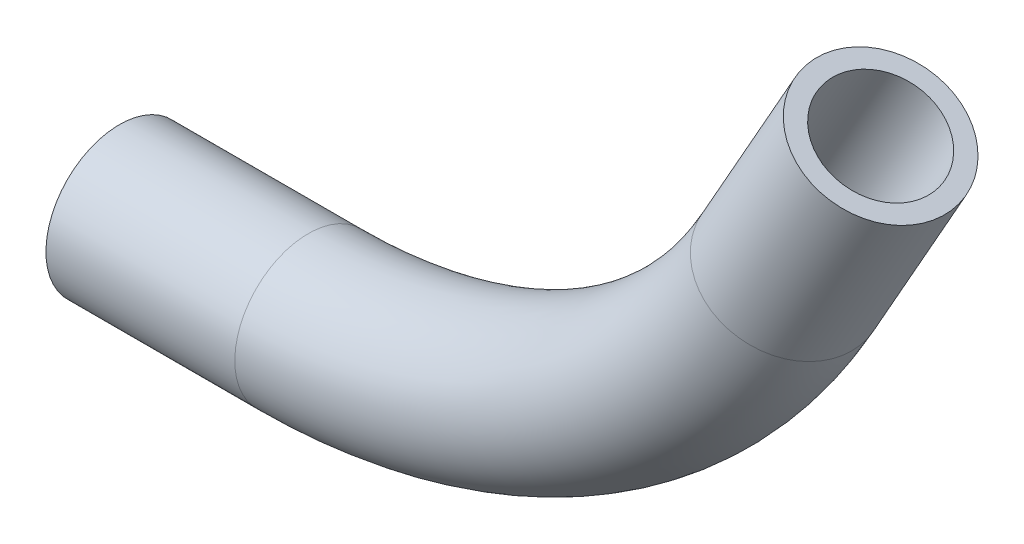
ISO-10303-21;
HEADER;
FILE_DESCRIPTION(('STEP AP214'),'2;1');
FILE_NAME('part.step','',(''),(''),'','','');
FILE_SCHEMA(('AUTOMOTIVE_DESIGN { 1 0 10303 214 1 1 1 1 }'));
ENDSEC;
DATA;
#1=APPLICATION_CONTEXT('core data for automotive mechanical design processes');
#2=APPLICATION_PROTOCOL_DEFINITION('international standard','automotive_design',2000,#1);
#3=PRODUCT_CONTEXT('',#1,'mechanical');
#4=PRODUCT('Part','Part','',(#3));
#5=PRODUCT_RELATED_PRODUCT_CATEGORY('part','',(#4));
#6=PRODUCT_DEFINITION_FORMATION('','',#4);
#7=PRODUCT_DEFINITION_CONTEXT('part definition',#1,'design');
#8=PRODUCT_DEFINITION('design','',#6,#7);
#9=PRODUCT_DEFINITION_SHAPE('','',#8);
#10=(LENGTH_UNIT() NAMED_UNIT(*) SI_UNIT(.MILLI.,.METRE.));
#11=(NAMED_UNIT(*) PLANE_ANGLE_UNIT() SI_UNIT($,.RADIAN.));
#12=(NAMED_UNIT(*) SI_UNIT($,.STERADIAN.) SOLID_ANGLE_UNIT());
#13=UNCERTAINTY_MEASURE_WITH_UNIT(LENGTH_MEASURE(1.E-05),#10,'distance_accuracy_value','');
#14=(GEOMETRIC_REPRESENTATION_CONTEXT(3) GLOBAL_UNCERTAINTY_ASSIGNED_CONTEXT((#13)) GLOBAL_UNIT_ASSIGNED_CONTEXT((#10,
#11,#12)) REPRESENTATION_CONTEXT('',''));
#15=CARTESIAN_POINT('',(0.,0.,0.));
#16=DIRECTION('',(0.,0.,1.));
#17=DIRECTION('',(1.,0.,0.));
#18=AXIS2_PLACEMENT_3D('',#15,#16,#17);
#19=CARTESIAN_POINT('',(18.1994388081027,7.61658031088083,0.));
#20=DIRECTION('',(0.492227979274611,0.870466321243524,0.));
#21=DIRECTION('',(-0.870466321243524,0.492227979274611,0.));
#22=AXIS2_PLACEMENT_3D('',#19,#20,#21);
#23=CYLINDRICAL_SURFACE('',#22,2.);
#24=CARTESIAN_POINT('',(18.1994388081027,7.61658031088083,0.));
#25=DIRECTION('',(0.492227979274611,0.870466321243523,0.));
#26=DIRECTION('',(0.,0.,-1.));
#27=AXIS2_PLACEMENT_3D('',#24,#25,#26);
#28=CIRCLE('',#27,2.);
#29=CARTESIAN_POINT('',(19.9403714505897,6.63212435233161,0.));
#30=VERTEX_POINT('',#29);
#31=EDGE_CURVE('E40',#30,#30,#28,.T.);
#32=ORIENTED_EDGE('',*,*,#31,.T.);
#33=EDGE_LOOP('',(#32));
#34=FACE_BOUND('',#33,.T.);
#35=CARTESIAN_POINT('',(20.7306936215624,12.0929046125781,0.));
#36=DIRECTION('',(0.492227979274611,0.870466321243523,0.));
#37=DIRECTION('',(0.,0.,-1.));
#38=AXIS2_PLACEMENT_3D('',#35,#36,#37);
#39=CIRCLE('',#38,2.);
#40=CARTESIAN_POINT('',(20.7306936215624,12.0929046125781,-2.));
#41=VERTEX_POINT('',#40);
#42=EDGE_CURVE('E10',#41,#41,#39,.T.);
#43=ORIENTED_EDGE('',*,*,#42,.F.);
#44=EDGE_LOOP('',(#43));
#45=FACE_BOUND('',#44,.T.);
#46=ADVANCED_FACE('F30',(#34,#45),#23,.T.);
#47=CARTESIAN_POINT('',(18.1994388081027,7.61658031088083,0.));
#48=DIRECTION('',(0.492227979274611,0.870466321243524,0.));
#49=DIRECTION('',(-0.870466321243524,0.492227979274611,0.));
#50=AXIS2_PLACEMENT_3D('',#47,#48,#49);
#51=CYLINDRICAL_SURFACE('',#50,1.5);
#52=CARTESIAN_POINT('',(18.1994388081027,7.61658031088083,0.));
#53=DIRECTION('',(0.492227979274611,0.870466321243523,0.));
#54=DIRECTION('',(0.,0.,-1.));
#55=AXIS2_PLACEMENT_3D('',#52,#53,#54);
#56=CIRCLE('',#55,1.5);
#57=CARTESIAN_POINT('',(19.5051382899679,6.87823834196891,0.));
#58=VERTEX_POINT('',#57);
#59=EDGE_CURVE('E44',#58,#58,#56,.T.);
#60=ORIENTED_EDGE('',*,*,#59,.F.);
#61=EDGE_LOOP('',(#60));
#62=FACE_BOUND('',#61,.T.);
#63=CARTESIAN_POINT('',(20.7306936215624,12.0929046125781,0.));
#64=DIRECTION('',(0.492227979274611,0.870466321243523,0.));
#65=DIRECTION('',(0.,0.,-1.));
#66=AXIS2_PLACEMENT_3D('',#63,#64,#65);
#67=CIRCLE('',#66,1.5);
#68=CARTESIAN_POINT('',(20.7306936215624,12.0929046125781,-1.5));
#69=VERTEX_POINT('',#68);
#70=EDGE_CURVE('E36',#69,#69,#67,.T.);
#71=ORIENTED_EDGE('',*,*,#70,.T.);
#72=EDGE_LOOP('',(#71));
#73=FACE_BOUND('',#72,.T.);
#74=ADVANCED_FACE('F72',(#62,#73),#51,.F.);
#75=CARTESIAN_POINT('',(5.14244398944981,15.,0.));
#76=DIRECTION('',(0.,0.,1.));
#77=DIRECTION('',(1.,0.,0.));
#78=AXIS2_PLACEMENT_3D('',#75,#76,#77);
#79=TOROIDAL_SURFACE('',#78,15.,2.);
#80=CARTESIAN_POINT('',(5.14244398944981,0.,0.));
#81=DIRECTION('',(1.,0.,0.));
#82=DIRECTION('',(0.,0.,-1.));
#83=AXIS2_PLACEMENT_3D('',#80,#81,#82);
#84=CIRCLE('',#83,2.);
#85=CARTESIAN_POINT('',(5.14244398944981,-2.,0.));
#86=VERTEX_POINT('',#85);
#87=EDGE_CURVE('E49',#86,#86,#84,.T.);
#88=CARTESIAN_POINT('',(5.14244398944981,15.,0.));
#89=DIRECTION('',(0.,0.,1.));
#90=DIRECTION('',(1.,0.,0.));
#91=AXIS2_PLACEMENT_3D('',#88,#89,#90);
#92=CIRCLE('',#91,17.);
#93=EDGE_CURVE('',#86,#30,#92,.T.);
#94=ORIENTED_EDGE('',*,*,#87,.T.);
#95=ORIENTED_EDGE('',*,*,#31,.F.);
#96=ORIENTED_EDGE('',*,*,#93,.T.);
#97=ORIENTED_EDGE('',*,*,#93,.F.);
#98=EDGE_LOOP('',(#94,#96,#95,#97));
#99=FACE_BOUND('',#98,.T.);
#100=ADVANCED_FACE('F68',(#99),#79,.T.);
#101=CARTESIAN_POINT('',(5.14244398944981,15.,0.));
#102=DIRECTION('',(0.,0.,1.));
#103=DIRECTION('',(1.,0.,0.));
#104=AXIS2_PLACEMENT_3D('',#101,#102,#103);
#105=TOROIDAL_SURFACE('',#104,15.,1.5);
#106=CARTESIAN_POINT('',(5.14244398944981,0.,0.));
#107=DIRECTION('',(1.,0.,0.));
#108=DIRECTION('',(0.,0.,-1.));
#109=AXIS2_PLACEMENT_3D('',#106,#107,#108);
#110=CIRCLE('',#109,1.5);
#111=CARTESIAN_POINT('',(5.14244398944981,-1.5,0.));
#112=VERTEX_POINT('',#111);
#113=EDGE_CURVE('E53',#112,#112,#110,.T.);
#114=CARTESIAN_POINT('',(5.14244398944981,15.,0.));
#115=DIRECTION('',(0.,0.,1.));
#116=DIRECTION('',(1.,0.,0.));
#117=AXIS2_PLACEMENT_3D('',#114,#115,#116);
#118=CIRCLE('',#117,16.5);
#119=EDGE_CURVE('',#112,#58,#118,.T.);
#120=ORIENTED_EDGE('',*,*,#113,.F.);
#121=ORIENTED_EDGE('',*,*,#59,.T.);
#122=ORIENTED_EDGE('',*,*,#119,.T.);
#123=ORIENTED_EDGE('',*,*,#119,.F.);
#124=EDGE_LOOP('',(#120,#122,#121,#123));
#125=FACE_BOUND('',#124,.T.);
#126=ADVANCED_FACE('F65',(#125),#105,.F.);
#127=CARTESIAN_POINT('',(5.14244398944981,0.,0.));
#128=DIRECTION('',(-1.,0.,0.));
#129=DIRECTION('',(0.,-1.,0.));
#130=AXIS2_PLACEMENT_3D('',#127,#128,#129);
#131=CYLINDRICAL_SURFACE('',#130,1.5);
#132=ORIENTED_EDGE('',*,*,#113,.T.);
#133=EDGE_LOOP('',(#132));
#134=FACE_BOUND('',#133,.T.);
#135=CARTESIAN_POINT('',(0.,0.,0.));
#136=DIRECTION('',(1.,0.,0.));
#137=DIRECTION('',(0.,0.,-1.));
#138=AXIS2_PLACEMENT_3D('',#135,#136,#137);
#139=CIRCLE('',#138,1.5);
#140=CARTESIAN_POINT('',(0.,0.,-1.5));
#141=VERTEX_POINT('',#140);
#142=EDGE_CURVE('E54',#141,#141,#139,.T.);
#143=ORIENTED_EDGE('',*,*,#142,.F.);
#144=EDGE_LOOP('',(#143));
#145=FACE_BOUND('',#144,.T.);
#146=ADVANCED_FACE('F62',(#134,#145),#131,.F.);
#147=CARTESIAN_POINT('',(5.14244398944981,0.,0.));
#148=DIRECTION('',(-1.,0.,0.));
#149=DIRECTION('',(0.,-1.,0.));
#150=AXIS2_PLACEMENT_3D('',#147,#148,#149);
#151=CYLINDRICAL_SURFACE('',#150,2.);
#152=ORIENTED_EDGE('',*,*,#87,.F.);
#153=EDGE_LOOP('',(#152));
#154=FACE_BOUND('',#153,.T.);
#155=CARTESIAN_POINT('',(0.,0.,0.));
#156=DIRECTION('',(1.,0.,0.));
#157=DIRECTION('',(0.,0.,-1.));
#158=AXIS2_PLACEMENT_3D('',#155,#156,#157);
#159=CIRCLE('',#158,2.);
#160=CARTESIAN_POINT('',(0.,0.,-2.));
#161=VERTEX_POINT('',#160);
#162=EDGE_CURVE('E50',#161,#161,#159,.T.);
#163=ORIENTED_EDGE('',*,*,#162,.T.);
#164=EDGE_LOOP('',(#163));
#165=FACE_BOUND('',#164,.T.);
#166=ADVANCED_FACE('F84',(#154,#165),#151,.T.);
#167=CARTESIAN_POINT('',(20.7306936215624,12.0929046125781,0.));
#168=DIRECTION('',(0.492227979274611,0.870466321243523,0.));
#169=DIRECTION('',(0.,0.,-1.));
#170=AXIS2_PLACEMENT_3D('',#167,#168,#169);
#171=PLANE('',#170);
#172=ORIENTED_EDGE('',*,*,#70,.F.);
#173=EDGE_LOOP('',(#172));
#174=FACE_BOUND('',#173,.T.);
#175=ORIENTED_EDGE('',*,*,#42,.T.);
#176=EDGE_LOOP('',(#175));
#177=FACE_BOUND('',#176,.T.);
#178=ADVANCED_FACE('F87',(#174,#177),#171,.T.);
#179=CARTESIAN_POINT('',(0.,0.,0.));
#180=DIRECTION('',(1.,0.,0.));
#181=DIRECTION('',(0.,0.,-1.));
#182=AXIS2_PLACEMENT_3D('',#179,#180,#181);
#183=PLANE('',#182);
#184=ORIENTED_EDGE('',*,*,#142,.T.);
#185=EDGE_LOOP('',(#184));
#186=FACE_BOUND('',#185,.T.);
#187=ORIENTED_EDGE('',*,*,#162,.F.);
#188=EDGE_LOOP('',(#187));
#189=FACE_BOUND('',#188,.T.);
#190=ADVANCED_FACE('F89',(#186,#189),#183,.F.);
#191=CLOSED_SHELL('',(#46,#74,#100,#126,#146,#166,#178,#190));
#192=MANIFOLD_SOLID_BREP('B2',#191);
#193=ADVANCED_BREP_SHAPE_REPRESENTATION('',(#18,#192),#14);
#194=SHAPE_DEFINITION_REPRESENTATION(#9,#193);
ENDSEC;
END-ISO-10303-21;
